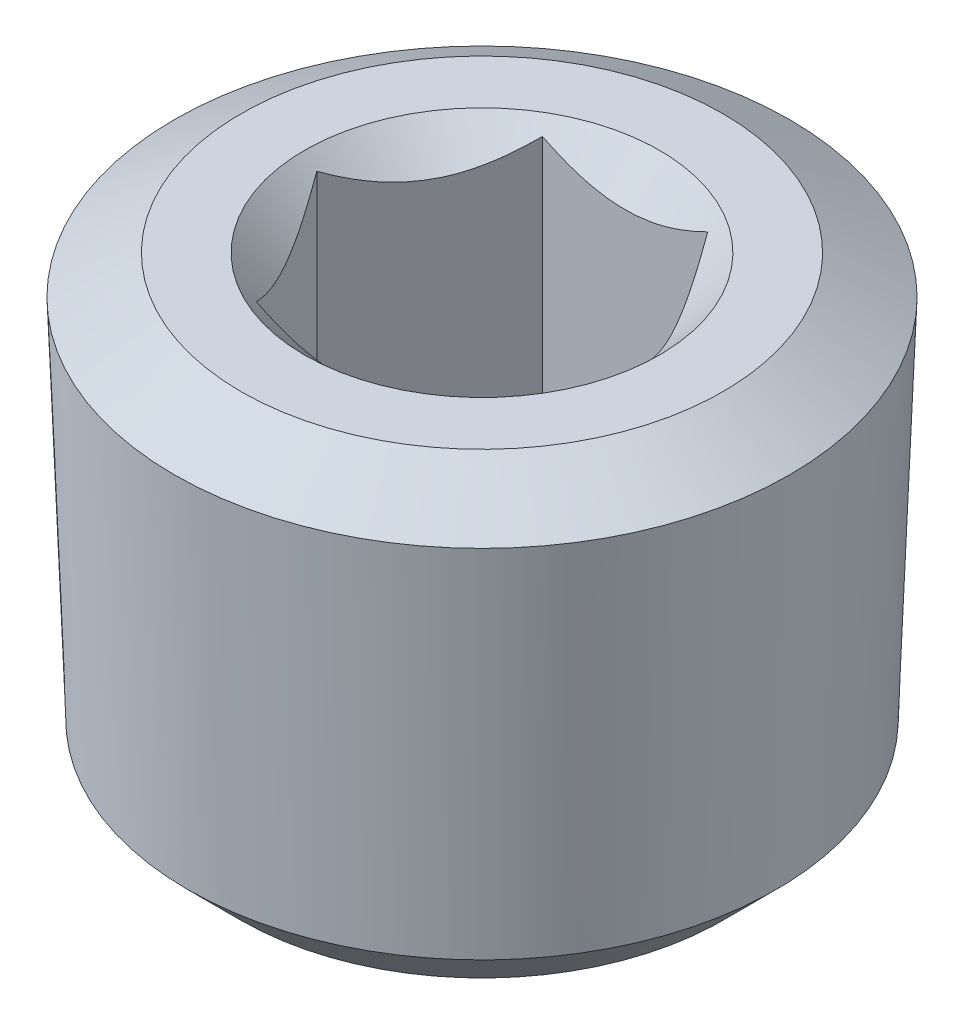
ISO-10303-21;
HEADER;
FILE_DESCRIPTION(('STEP AP214'),'2;1');
FILE_NAME('part.step','',(''),(''),'','','');
FILE_SCHEMA(('AUTOMOTIVE_DESIGN { 1 0 10303 214 1 1 1 1 }'));
ENDSEC;
DATA;
#1=APPLICATION_CONTEXT('core data for automotive mechanical design processes');
#2=APPLICATION_PROTOCOL_DEFINITION('international standard','automotive_design',2000,#1);
#3=PRODUCT_CONTEXT('',#1,'mechanical');
#4=PRODUCT('Part','Part','',(#3));
#5=PRODUCT_RELATED_PRODUCT_CATEGORY('part','',(#4));
#6=PRODUCT_DEFINITION_FORMATION('','',#4);
#7=PRODUCT_DEFINITION_CONTEXT('part definition',#1,'design');
#8=PRODUCT_DEFINITION('design','',#6,#7);
#9=PRODUCT_DEFINITION_SHAPE('','',#8);
#10=(LENGTH_UNIT() NAMED_UNIT(*) SI_UNIT(.MILLI.,.METRE.));
#11=(NAMED_UNIT(*) PLANE_ANGLE_UNIT() SI_UNIT($,.RADIAN.));
#12=(NAMED_UNIT(*) SI_UNIT($,.STERADIAN.) SOLID_ANGLE_UNIT());
#13=UNCERTAINTY_MEASURE_WITH_UNIT(LENGTH_MEASURE(1.E-05),#10,'distance_accuracy_value','');
#14=(GEOMETRIC_REPRESENTATION_CONTEXT(3) GLOBAL_UNCERTAINTY_ASSIGNED_CONTEXT((#13)) GLOBAL_UNIT_ASSIGNED_CONTEXT((#10,
#11,#12)) REPRESENTATION_CONTEXT('',''));
#15=CARTESIAN_POINT('',(0.,0.,0.));
#16=DIRECTION('',(0.,0.,1.));
#17=DIRECTION('',(1.,0.,0.));
#18=AXIS2_PLACEMENT_3D('',#15,#16,#17);
#19=CARTESIAN_POINT('',(0.,0.,0.));
#20=DIRECTION('',(0.,1.,0.));
#21=DIRECTION('',(0.,0.,1.));
#22=AXIS2_PLACEMENT_3D('',#19,#20,#21);
#23=PLANE('',#22);
#24=CARTESIAN_POINT('',(0.,0.,0.));
#25=DIRECTION('',(0.,1.,0.));
#26=DIRECTION('',(0.,0.,1.));
#27=AXIS2_PLACEMENT_3D('',#24,#25,#26);
#28=CIRCLE('',#27,3.937);
#29=CARTESIAN_POINT('',(0.,0.,3.937));
#30=VERTEX_POINT('',#29);
#31=EDGE_CURVE('E246',#30,#30,#28,.T.);
#32=ORIENTED_EDGE('',*,*,#31,.F.);
#33=EDGE_LOOP('',(#32));
#34=FACE_BOUND('',#33,.T.);
#35=CARTESIAN_POINT('',(0.,0.,0.));
#36=DIRECTION('',(0.,1.,0.));
#37=DIRECTION('',(0.,0.,1.));
#38=AXIS2_PLACEMENT_3D('',#35,#36,#37);
#39=CIRCLE('',#38,5.34458046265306);
#40=CARTESIAN_POINT('',(0.,0.,5.34458046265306));
#41=VERTEX_POINT('',#40);
#42=EDGE_CURVE('E12',#41,#41,#39,.T.);
#43=ORIENTED_EDGE('',*,*,#42,.T.);
#44=EDGE_LOOP('',(#43));
#45=FACE_BOUND('',#44,.T.);
#46=ADVANCED_FACE('F33',(#34,#45),#23,.T.);
#47=CARTESIAN_POINT('',(0.,0.,0.));
#48=DIRECTION('',(0.,-1.,0.));
#49=DIRECTION('',(0.,0.,-1.));
#50=AXIS2_PLACEMENT_3D('',#47,#48,#49);
#51=CONICAL_SURFACE('',#50,5.34458046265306,1.0471975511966);
#52=CARTESIAN_POINT('',(0.,-0.855759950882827,0.));
#53=DIRECTION('',(0.,1.,0.));
#54=DIRECTION('',(0.,0.,1.));
#55=AXIS2_PLACEMENT_3D('',#52,#53,#54);
#56=CIRCLE('',#55,6.82680017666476);
#57=CARTESIAN_POINT('',(0.,-0.855759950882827,6.82680017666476));
#58=VERTEX_POINT('',#57);
#59=EDGE_CURVE('E40',#58,#58,#56,.T.);
#60=ORIENTED_EDGE('',*,*,#59,.T.);
#61=EDGE_LOOP('',(#60));
#62=FACE_BOUND('',#61,.T.);
#63=ORIENTED_EDGE('',*,*,#42,.F.);
#64=EDGE_LOOP('',(#63));
#65=FACE_BOUND('',#64,.T.);
#66=ADVANCED_FACE('F236',(#62,#65),#51,.T.);
#67=CARTESIAN_POINT('',(0.,-0.855759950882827,0.));
#68=DIRECTION('',(0.,1.,0.));
#69=DIRECTION('',(0.,0.,1.));
#70=AXIS2_PLACEMENT_3D('',#67,#68,#69);
#71=CONICAL_SURFACE('',#70,6.82680017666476,0.0364424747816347);
#72=CARTESIAN_POINT('',(0.,-8.97375100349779,0.));
#73=DIRECTION('',(0.,1.,0.));
#74=DIRECTION('',(0.,0.,1.));
#75=AXIS2_PLACEMENT_3D('',#72,#73,#74);
#76=CIRCLE('',#75,6.53082945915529);
#77=CARTESIAN_POINT('',(0.,-8.97375100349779,6.53082945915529));
#78=VERTEX_POINT('',#77);
#79=EDGE_CURVE('E254',#78,#78,#76,.T.);
#80=ORIENTED_EDGE('',*,*,#79,.T.);
#81=EDGE_LOOP('',(#80));
#82=FACE_BOUND('',#81,.T.);
#83=ORIENTED_EDGE('',*,*,#59,.F.);
#84=EDGE_LOOP('',(#83));
#85=FACE_BOUND('',#84,.T.);
#86=ADVANCED_FACE('F241',(#82,#85),#71,.T.);
#87=CARTESIAN_POINT('',(0.,-8.97375100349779,0.));
#88=DIRECTION('',(0.,1.,0.));
#89=DIRECTION('',(0.,0.,1.));
#90=AXIS2_PLACEMENT_3D('',#87,#88,#89);
#91=CONICAL_SURFACE('',#90,6.53082945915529,0.785398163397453);
#92=CARTESIAN_POINT('',(0.,-10.16,0.));
#93=DIRECTION('',(0.,1.,0.));
#94=DIRECTION('',(0.,0.,1.));
#95=AXIS2_PLACEMENT_3D('',#92,#93,#94);
#96=CIRCLE('',#95,5.34458046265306);
#97=CARTESIAN_POINT('',(0.,-10.16,5.34458046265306));
#98=VERTEX_POINT('',#97);
#99=EDGE_CURVE('E250',#98,#98,#96,.T.);
#100=ORIENTED_EDGE('',*,*,#99,.T.);
#101=EDGE_LOOP('',(#100));
#102=FACE_BOUND('',#101,.T.);
#103=ORIENTED_EDGE('',*,*,#79,.F.);
#104=EDGE_LOOP('',(#103));
#105=FACE_BOUND('',#104,.T.);
#106=ADVANCED_FACE('F264',(#102,#105),#91,.T.);
#107=CARTESIAN_POINT('',(-5.34458046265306,-10.16,0.));
#108=DIRECTION('',(0.,-1.,0.));
#109=DIRECTION('',(0.,0.,-1.));
#110=AXIS2_PLACEMENT_3D('',#107,#108,#109);
#111=PLANE('',#110);
#112=ORIENTED_EDGE('',*,*,#99,.F.);
#113=EDGE_LOOP('',(#112));
#114=FACE_BOUND('',#113,.T.);
#115=ADVANCED_FACE('F180',(#114),#111,.T.);
#116=CARTESIAN_POINT('',(0.,0.,0.));
#117=DIRECTION('',(0.,1.,0.));
#118=DIRECTION('',(0.,0.,1.));
#119=AXIS2_PLACEMENT_3D('',#116,#117,#118);
#120=CONICAL_SURFACE('',#119,3.937,0.785398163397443);
#121=CARTESIAN_POINT('',(-3.93571910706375,1.11972916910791,3.175));
#122=CARTESIAN_POINT('',(-3.84104338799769,1.04605819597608,3.175));
#123=CARTESIAN_POINT('',(-3.7458702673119,0.973016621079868,3.175));
#124=CARTESIAN_POINT('',(-3.55432152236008,0.828483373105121,3.175));
#125=CARTESIAN_POINT('',(-3.45794562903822,0.756992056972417,3.175));
#126=CARTESIAN_POINT('',(-3.26308115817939,0.615342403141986,3.175));
#127=CARTESIAN_POINT('',(-3.1645820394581,0.545198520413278,3.175));
#128=CARTESIAN_POINT('',(-2.96596703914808,0.407246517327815,3.175));
#129=CARTESIAN_POINT('',(-2.86585126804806,0.339438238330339,3.175));
#130=CARTESIAN_POINT('',(-2.65689636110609,0.202214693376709,3.175));
#131=CARTESIAN_POINT('',(-2.5479247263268,0.133000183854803,3.175));
#132=CARTESIAN_POINT('',(-2.32741654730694,-0.0012864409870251,3.175));
#133=CARTESIAN_POINT('',(-2.21587956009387,-0.0663578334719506,3.175));
#134=CARTESIAN_POINT('',(-1.99018437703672,-0.190984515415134,3.175));
#135=CARTESIAN_POINT('',(-1.87603517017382,-0.250555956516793,3.175));
#136=CARTESIAN_POINT('',(-1.64444175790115,-0.362847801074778,3.175));
#137=CARTESIAN_POINT('',(-1.52699917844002,-0.415571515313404,3.175));
#138=CARTESIAN_POINT('',(-1.30155237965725,-0.506949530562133,3.175));
#139=CARTESIAN_POINT('',(-1.1939199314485,-0.546511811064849,3.175));
#140=CARTESIAN_POINT('',(-0.975818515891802,-0.61702882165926,3.175));
#141=CARTESIAN_POINT('',(-0.865349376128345,-0.647983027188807,3.175));
#142=CARTESIAN_POINT('',(-0.644216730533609,-0.699051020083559,3.175));
#143=CARTESIAN_POINT('',(-0.53360121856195,-0.719369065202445,3.175));
#144=CARTESIAN_POINT('',(-0.310874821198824,-0.748724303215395,3.175));
#145=CARTESIAN_POINT('',(-0.198764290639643,-0.757764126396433,3.175));
#146=CARTESIAN_POINT('',(0.0202799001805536,-0.763730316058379,3.175));
#147=CARTESIAN_POINT('',(0.127198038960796,-0.761228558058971,3.175));
#148=CARTESIAN_POINT('',(0.340248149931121,-0.745589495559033,3.175));
#149=CARTESIAN_POINT('',(0.446380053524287,-0.732451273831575,3.175));
#150=CARTESIAN_POINT('',(0.658892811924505,-0.696075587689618,3.175));
#151=CARTESIAN_POINT('',(0.765241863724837,-0.672655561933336,3.175));
#152=CARTESIAN_POINT('',(0.975578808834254,-0.617048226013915,3.175));
#153=CARTESIAN_POINT('',(1.07956679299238,-0.584861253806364,3.175));
#154=CARTESIAN_POINT('',(1.28885040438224,-0.511832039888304,3.175));
#155=CARTESIAN_POINT('',(1.39404662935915,-0.470708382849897,3.175));
#156=CARTESIAN_POINT('',(1.60173093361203,-0.382096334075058,3.175));
#157=CARTESIAN_POINT('',(1.70421815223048,-0.334605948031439,3.175));
#158=CARTESIAN_POINT('',(1.90698237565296,-0.234377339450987,3.175));
#159=CARTESIAN_POINT('',(2.0072512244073,-0.18162275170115,3.175));
#160=CARTESIAN_POINT('',(2.20549346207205,-0.0720283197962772,3.175));
#161=CARTESIAN_POINT('',(2.30346724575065,-0.0151891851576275,3.175));
#162=CARTESIAN_POINT('',(2.49264239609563,0.0988994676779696,3.175));
#163=CARTESIAN_POINT('',(2.58393963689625,0.155990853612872,3.175));
#164=CARTESIAN_POINT('',(2.76496520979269,0.272616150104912,3.175));
#165=CARTESIAN_POINT('',(2.85469342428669,0.3321502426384,3.175));
#166=CARTESIAN_POINT('',(3.03206818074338,0.45274472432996,3.175));
#167=CARTESIAN_POINT('',(3.11972562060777,0.513789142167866,3.175));
#168=CARTESIAN_POINT('',(3.29383610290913,0.637523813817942,3.175));
#169=CARTESIAN_POINT('',(3.38028947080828,0.700213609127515,3.175));
#170=CARTESIAN_POINT('',(3.46623735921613,0.763577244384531,3.175));
#171=B_SPLINE_CURVE_WITH_KNOTS('',3,(#121,#122,#123,#124,#125,#126,#127,#128,#129,#130,#131,
#132,#133,#134,#135,#136,#137,#138,#139,#140,#141,#142,#143,#144,#145,#146,#147,#148,#149,#150,
#151,#152,#153,#154,#155,#156,#157,#158,#159,#160,#161,#162,#163,#164,#165,#166,#167,#168,#169,
#170),.UNSPECIFIED.,.F.,.F.,(4,2,2,2,2,2,2,2,2,2,2,2,2,2,2,2,2,2,2,2,2,2,2,2,4),(0.,
0.359892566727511,0.719867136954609,1.08260645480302,1.44532108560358,1.83253224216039,
2.21981077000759,2.60591317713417,2.99182820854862,3.33555423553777,3.67930120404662,
4.01617928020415,4.35297877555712,4.67327447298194,4.99359779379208,5.31985449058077,
5.64609861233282,5.98468714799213,6.32338199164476,6.66316466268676,7.00288845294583,
7.3258777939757,7.64889124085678,7.96932699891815,8.28967439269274),.UNSPECIFIED.);
#172=CARTESIAN_POINT('',(1.83308710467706,-0.27082579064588,3.175));
#173=VERTEX_POINT('',#172);
#174=CARTESIAN_POINT('',(-1.83308710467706,-0.27082579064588,3.175));
#175=VERTEX_POINT('',#174);
#176=EDGE_CURVE('E47',#173,#175,#171,.F.);
#177=ORIENTED_EDGE('',*,*,#176,.T.);
#178=CARTESIAN_POINT('',(-1.83297163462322,-0.270710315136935,3.1752));
#179=CARTESIAN_POINT('',(-1.89598269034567,-0.333666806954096,3.06606165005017));
#180=CARTESIAN_POINT('',(-1.9600473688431,-0.392925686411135,2.95509837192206));
#181=CARTESIAN_POINT('',(-2.09068223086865,-0.501427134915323,2.72883215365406));
#182=CARTESIAN_POINT('',(-2.15726483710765,-0.550609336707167,2.61350769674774));
#183=CARTESIAN_POINT('',(-2.29152545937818,-0.634859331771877,2.38096147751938));
#184=CARTESIAN_POINT('',(-2.35916928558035,-0.670138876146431,2.26379893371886));
#185=CARTESIAN_POINT('',(-2.49594609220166,-0.724494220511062,2.02689455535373));
#186=CARTESIAN_POINT('',(-2.56507489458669,-0.743610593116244,1.90715995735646));
#187=CARTESIAN_POINT('',(-2.68421566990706,-0.760858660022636,1.70080208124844));
#188=CARTESIAN_POINT('',(-2.73407378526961,-0.763411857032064,1.61444529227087));
#189=CARTESIAN_POINT('',(-2.83370891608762,-0.759109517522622,1.44187218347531));
#190=CARTESIAN_POINT('',(-2.88348589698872,-0.752250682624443,1.35565592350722));
#191=CARTESIAN_POINT('',(-2.98256827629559,-0.729515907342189,1.1840402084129));
#192=CARTESIAN_POINT('',(-3.03187308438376,-0.713629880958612,1.09864177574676));
#193=CARTESIAN_POINT('',(-3.12963590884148,-0.673707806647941,0.929311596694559));
#194=CARTESIAN_POINT('',(-3.17809398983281,-0.649672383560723,0.845379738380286));
#195=CARTESIAN_POINT('',(-3.26412109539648,-0.600220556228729,0.696376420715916));
#196=CARTESIAN_POINT('',(-3.30188053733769,-0.576104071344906,0.630975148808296));
#197=CARTESIAN_POINT('',(-3.37672152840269,-0.523984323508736,0.501346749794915));
#198=CARTESIAN_POINT('',(-3.41380305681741,-0.495980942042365,0.437119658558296));
#199=CARTESIAN_POINT('',(-3.48717139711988,-0.436715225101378,0.310041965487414));
#200=CARTESIAN_POINT('',(-3.52346029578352,-0.405463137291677,0.247187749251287));
#201=CARTESIAN_POINT('',(-3.59536602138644,-0.340110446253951,0.122643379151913));
#202=CARTESIAN_POINT('',(-3.63098324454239,-0.306011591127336,0.0609525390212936));
#203=CARTESIAN_POINT('',(-3.66628967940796,-0.270710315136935,-0.000199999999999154));
#204=B_SPLINE_CURVE_WITH_KNOTS('',3,(#178,#179,#180,#181,#182,#183,#184,#185,#186,#187,#188,
#189,#190,#191,#192,#193,#194,#195,#196,#197,#198,#199,#200,#201,#202,#203),.UNSPECIFIED.,.F.,
.F.,(4,2,2,2,2,2,2,2,2,2,2,2,4),(0.,0.422910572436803,0.848285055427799,1.26690402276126,
1.68446903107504,1.98329272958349,2.28222117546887,2.58148426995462,2.88072442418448,
3.11844134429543,3.35616551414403,3.59316134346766,3.8300126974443),.UNSPECIFIED.);
#205=CARTESIAN_POINT('',(-3.66617420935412,-0.270825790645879,0.));
#206=VERTEX_POINT('',#205);
#207=EDGE_CURVE('E122',#175,#206,#204,.T.);
#208=ORIENTED_EDGE('',*,*,#207,.T.);
#209=CARTESIAN_POINT('',(-3.66628967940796,-0.270710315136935,0.000200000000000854));
#210=CARTESIAN_POINT('',(-3.60327862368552,-0.333666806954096,-0.108938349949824));
#211=CARTESIAN_POINT('',(-3.53921394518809,-0.392925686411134,-0.219901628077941));
#212=CARTESIAN_POINT('',(-3.40857908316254,-0.501427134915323,-0.44616784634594));
#213=CARTESIAN_POINT('',(-3.34199647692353,-0.550609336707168,-0.561492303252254));
#214=CARTESIAN_POINT('',(-3.20773585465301,-0.634859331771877,-0.794038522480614));
#215=CARTESIAN_POINT('',(-3.14009202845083,-0.670138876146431,-0.911201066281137));
#216=CARTESIAN_POINT('',(-3.00331522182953,-0.724494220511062,-1.14810544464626));
#217=CARTESIAN_POINT('',(-2.93418641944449,-0.743610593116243,-1.26784004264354));
#218=CARTESIAN_POINT('',(-2.81504564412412,-0.760858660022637,-1.47419791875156));
#219=CARTESIAN_POINT('',(-2.76518752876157,-0.763411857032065,-1.56055470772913));
#220=CARTESIAN_POINT('',(-2.66555239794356,-0.759109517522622,-1.73312781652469));
#221=CARTESIAN_POINT('',(-2.61577541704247,-0.752250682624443,-1.81934407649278));
#222=CARTESIAN_POINT('',(-2.51669303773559,-0.729515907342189,-1.9909597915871));
#223=CARTESIAN_POINT('',(-2.46738822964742,-0.713629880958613,-2.07635822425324));
#224=CARTESIAN_POINT('',(-2.36962540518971,-0.673707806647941,-2.24568840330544));
#225=CARTESIAN_POINT('',(-2.32116732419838,-0.649672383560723,-2.32962026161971));
#226=CARTESIAN_POINT('',(-2.2351402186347,-0.600220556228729,-2.47862357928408));
#227=CARTESIAN_POINT('',(-2.1973807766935,-0.576104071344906,-2.5440248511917));
#228=CARTESIAN_POINT('',(-2.1225397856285,-0.523984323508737,-2.67365325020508));
#229=CARTESIAN_POINT('',(-2.08545825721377,-0.495980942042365,-2.7378803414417));
#230=CARTESIAN_POINT('',(-2.0120899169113,-0.436715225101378,-2.86495803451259));
#231=CARTESIAN_POINT('',(-1.97580101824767,-0.405463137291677,-2.92781225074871));
#232=CARTESIAN_POINT('',(-1.90389529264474,-0.340110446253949,-3.05235662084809));
#233=CARTESIAN_POINT('',(-1.8682780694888,-0.306011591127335,-3.11404746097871));
#234=CARTESIAN_POINT('',(-1.83297163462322,-0.270710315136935,-3.1752));
#235=B_SPLINE_CURVE_WITH_KNOTS('',3,(#209,#210,#211,#212,#213,#214,#215,#216,#217,#218,#219,
#220,#221,#222,#223,#224,#225,#226,#227,#228,#229,#230,#231,#232,#233,#234),.UNSPECIFIED.,.F.,
.F.,(4,2,2,2,2,2,2,2,2,2,2,2,4),(0.,0.422910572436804,0.848285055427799,1.26690402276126,
1.68446903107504,1.98329272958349,2.28222117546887,2.58148426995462,2.88072442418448,
3.11844134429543,3.35616551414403,3.59316134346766,3.8300126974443),.UNSPECIFIED.);
#236=CARTESIAN_POINT('',(-1.83308710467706,-0.270825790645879,-3.175));
#237=VERTEX_POINT('',#236);
#238=EDGE_CURVE('E203',#206,#237,#235,.T.);
#239=ORIENTED_EDGE('',*,*,#238,.T.);
#240=CARTESIAN_POINT('',(-3.93571910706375,1.11972916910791,-3.175));
#241=CARTESIAN_POINT('',(-3.84104338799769,1.04605819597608,-3.175));
#242=CARTESIAN_POINT('',(-3.7458702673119,0.97301662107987,-3.175));
#243=CARTESIAN_POINT('',(-3.55432152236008,0.828483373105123,-3.175));
#244=CARTESIAN_POINT('',(-3.45794562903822,0.756992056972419,-3.175));
#245=CARTESIAN_POINT('',(-3.26308115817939,0.615342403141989,-3.175));
#246=CARTESIAN_POINT('',(-3.1645820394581,0.545198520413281,-3.175));
#247=CARTESIAN_POINT('',(-2.96596703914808,0.407246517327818,-3.175));
#248=CARTESIAN_POINT('',(-2.86585126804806,0.339438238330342,-3.175));
#249=CARTESIAN_POINT('',(-2.6568963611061,0.20221469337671,-3.175));
#250=CARTESIAN_POINT('',(-2.54792472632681,0.133000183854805,-3.175));
#251=CARTESIAN_POINT('',(-2.32741654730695,-0.00128644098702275,-3.175));
#252=CARTESIAN_POINT('',(-2.21587956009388,-0.0663578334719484,-3.175));
#253=CARTESIAN_POINT('',(-1.99018437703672,-0.190984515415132,-3.175));
#254=CARTESIAN_POINT('',(-1.87603517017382,-0.250555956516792,-3.175));
#255=CARTESIAN_POINT('',(-1.64444175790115,-0.362847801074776,-3.175));
#256=CARTESIAN_POINT('',(-1.52699917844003,-0.415571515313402,-3.175));
#257=CARTESIAN_POINT('',(-1.30155237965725,-0.506949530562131,-3.175));
#258=CARTESIAN_POINT('',(-1.1939199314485,-0.546511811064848,-3.175));
#259=CARTESIAN_POINT('',(-0.975818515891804,-0.617028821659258,-3.175));
#260=CARTESIAN_POINT('',(-0.865349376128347,-0.647983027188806,-3.175));
#261=CARTESIAN_POINT('',(-0.64421673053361,-0.699051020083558,-3.175));
#262=CARTESIAN_POINT('',(-0.533601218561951,-0.719369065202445,-3.175));
#263=CARTESIAN_POINT('',(-0.310874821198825,-0.748724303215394,-3.175));
#264=CARTESIAN_POINT('',(-0.198764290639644,-0.757764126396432,-3.175));
#265=CARTESIAN_POINT('',(0.0202799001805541,-0.763730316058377,-3.175));
#266=CARTESIAN_POINT('',(0.127198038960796,-0.761228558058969,-3.175));
#267=CARTESIAN_POINT('',(0.340248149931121,-0.745589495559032,-3.175));
#268=CARTESIAN_POINT('',(0.446380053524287,-0.732451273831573,-3.175));
#269=CARTESIAN_POINT('',(0.658892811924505,-0.696075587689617,-3.175));
#270=CARTESIAN_POINT('',(0.765241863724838,-0.672655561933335,-3.175));
#271=CARTESIAN_POINT('',(0.975578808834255,-0.617048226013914,-3.175));
#272=CARTESIAN_POINT('',(1.07956679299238,-0.584861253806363,-3.175));
#273=CARTESIAN_POINT('',(1.28885040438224,-0.511832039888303,-3.175));
#274=CARTESIAN_POINT('',(1.39404662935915,-0.470708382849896,-3.175));
#275=CARTESIAN_POINT('',(1.60173093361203,-0.382096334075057,-3.175));
#276=CARTESIAN_POINT('',(1.70421815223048,-0.334605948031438,-3.175));
#277=CARTESIAN_POINT('',(1.90698237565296,-0.234377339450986,-3.175));
#278=CARTESIAN_POINT('',(2.0072512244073,-0.181622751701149,-3.175));
#279=CARTESIAN_POINT('',(2.20549346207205,-0.0720283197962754,-3.175));
#280=CARTESIAN_POINT('',(2.30346724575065,-0.0151891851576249,-3.175));
#281=CARTESIAN_POINT('',(2.49264239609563,0.0988994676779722,-3.175));
#282=CARTESIAN_POINT('',(2.58393963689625,0.155990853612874,-3.175));
#283=CARTESIAN_POINT('',(2.76496520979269,0.272616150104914,-3.175));
#284=CARTESIAN_POINT('',(2.85469342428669,0.332150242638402,-3.175));
#285=CARTESIAN_POINT('',(3.03206818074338,0.452744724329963,-3.175));
#286=CARTESIAN_POINT('',(3.11972562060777,0.513789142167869,-3.175));
#287=CARTESIAN_POINT('',(3.29383610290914,0.637523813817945,-3.175));
#288=CARTESIAN_POINT('',(3.38028947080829,0.700213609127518,-3.175));
#289=CARTESIAN_POINT('',(3.46623735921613,0.763577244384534,-3.175));
#290=B_SPLINE_CURVE_WITH_KNOTS('',3,(#240,#241,#242,#243,#244,#245,#246,#247,#248,#249,#250,
#251,#252,#253,#254,#255,#256,#257,#258,#259,#260,#261,#262,#263,#264,#265,#266,#267,#268,#269,
#270,#271,#272,#273,#274,#275,#276,#277,#278,#279,#280,#281,#282,#283,#284,#285,#286,#287,#288,
#289),.UNSPECIFIED.,.F.,.F.,(4,2,2,2,2,2,2,2,2,2,2,2,2,2,2,2,2,2,2,2,2,2,2,2,4),(0.,
0.35989256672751,0.719867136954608,1.08260645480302,1.44532108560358,1.83253224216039,
2.21981077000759,2.60591317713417,2.99182820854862,3.33555423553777,3.67930120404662,
4.01617928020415,4.35297877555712,4.67327447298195,4.99359779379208,5.31985449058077,
5.64609861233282,5.98468714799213,6.32338199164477,6.66316466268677,7.00288845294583,
7.3258777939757,7.64889124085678,7.96932699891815,8.28967439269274),.UNSPECIFIED.);
#291=CARTESIAN_POINT('',(1.83308710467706,-0.27082579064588,-3.175));
#292=VERTEX_POINT('',#291);
#293=EDGE_CURVE('E196',#237,#292,#290,.T.);
#294=ORIENTED_EDGE('',*,*,#293,.T.);
#295=CARTESIAN_POINT('',(1.83297163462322,-0.270710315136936,-3.1752));
#296=CARTESIAN_POINT('',(1.89598269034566,-0.333666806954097,-3.06606165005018));
#297=CARTESIAN_POINT('',(1.9600473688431,-0.392925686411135,-2.95509837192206));
#298=CARTESIAN_POINT('',(2.09068223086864,-0.501427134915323,-2.72883215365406));
#299=CARTESIAN_POINT('',(2.15726483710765,-0.550609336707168,-2.61350769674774));
#300=CARTESIAN_POINT('',(2.29152545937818,-0.634859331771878,-2.38096147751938));
#301=CARTESIAN_POINT('',(2.35916928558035,-0.670138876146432,-2.26379893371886));
#302=CARTESIAN_POINT('',(2.49594609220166,-0.724494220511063,-2.02689455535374));
#303=CARTESIAN_POINT('',(2.56507489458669,-0.743610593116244,-1.90715995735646));
#304=CARTESIAN_POINT('',(2.68421566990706,-0.760858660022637,-1.70080208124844));
#305=CARTESIAN_POINT('',(2.73407378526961,-0.763411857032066,-1.61444529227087));
#306=CARTESIAN_POINT('',(2.83370891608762,-0.759109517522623,-1.44187218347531));
#307=CARTESIAN_POINT('',(2.88348589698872,-0.752250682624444,-1.35565592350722));
#308=CARTESIAN_POINT('',(2.98256827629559,-0.72951590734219,-1.1840402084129));
#309=CARTESIAN_POINT('',(3.03187308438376,-0.713629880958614,-1.09864177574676));
#310=CARTESIAN_POINT('',(3.12963590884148,-0.673707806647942,-0.92931159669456));
#311=CARTESIAN_POINT('',(3.17809398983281,-0.649672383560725,-0.845379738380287));
#312=CARTESIAN_POINT('',(3.26412109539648,-0.60022055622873,-0.696376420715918));
#313=CARTESIAN_POINT('',(3.30188053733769,-0.576104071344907,-0.630975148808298));
#314=CARTESIAN_POINT('',(3.37672152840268,-0.523984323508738,-0.501346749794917));
#315=CARTESIAN_POINT('',(3.41380305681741,-0.495980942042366,-0.437119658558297));
#316=CARTESIAN_POINT('',(3.48717139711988,-0.436715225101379,-0.310041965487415));
#317=CARTESIAN_POINT('',(3.52346029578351,-0.405463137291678,-0.247187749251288));
#318=CARTESIAN_POINT('',(3.59536602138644,-0.340110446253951,-0.122643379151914));
#319=CARTESIAN_POINT('',(3.63098324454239,-0.306011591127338,-0.0609525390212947));
#320=CARTESIAN_POINT('',(3.66628967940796,-0.270710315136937,0.000199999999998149));
#321=B_SPLINE_CURVE_WITH_KNOTS('',3,(#295,#296,#297,#298,#299,#300,#301,#302,#303,#304,#305,
#306,#307,#308,#309,#310,#311,#312,#313,#314,#315,#316,#317,#318,#319,#320),.UNSPECIFIED.,.F.,
.F.,(4,2,2,2,2,2,2,2,2,2,2,2,4),(0.,0.422910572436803,0.848285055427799,1.26690402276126,
1.68446903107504,1.98329272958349,2.28222117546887,2.58148426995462,2.88072442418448,
3.11844134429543,3.35616551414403,3.59316134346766,3.8300126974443),.UNSPECIFIED.);
#322=CARTESIAN_POINT('',(3.66617420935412,-0.270825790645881,0.));
#323=VERTEX_POINT('',#322);
#324=EDGE_CURVE('E189',#292,#323,#321,.T.);
#325=ORIENTED_EDGE('',*,*,#324,.T.);
#326=CARTESIAN_POINT('',(3.66628967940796,-0.270710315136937,-0.000200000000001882));
#327=CARTESIAN_POINT('',(3.60327862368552,-0.333666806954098,0.108938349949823));
#328=CARTESIAN_POINT('',(3.53921394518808,-0.392925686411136,0.219901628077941));
#329=CARTESIAN_POINT('',(3.40857908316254,-0.501427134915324,0.44616784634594));
#330=CARTESIAN_POINT('',(3.34199647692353,-0.550609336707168,0.561492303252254));
#331=CARTESIAN_POINT('',(3.20773585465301,-0.634859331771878,0.794038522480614));
#332=CARTESIAN_POINT('',(3.14009202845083,-0.670138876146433,0.911201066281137));
#333=CARTESIAN_POINT('',(3.00331522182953,-0.724494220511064,1.14810544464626));
#334=CARTESIAN_POINT('',(2.93418641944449,-0.743610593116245,1.26784004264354));
#335=CARTESIAN_POINT('',(2.81504564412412,-0.760858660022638,1.47419791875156));
#336=CARTESIAN_POINT('',(2.76518752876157,-0.763411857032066,1.56055470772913));
#337=CARTESIAN_POINT('',(2.66555239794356,-0.759109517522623,1.73312781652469));
#338=CARTESIAN_POINT('',(2.61577541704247,-0.752250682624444,1.81934407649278));
#339=CARTESIAN_POINT('',(2.51669303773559,-0.72951590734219,1.9909597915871));
#340=CARTESIAN_POINT('',(2.46738822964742,-0.713629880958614,2.07635822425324));
#341=CARTESIAN_POINT('',(2.36962540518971,-0.673707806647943,2.24568840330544));
#342=CARTESIAN_POINT('',(2.32116732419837,-0.649672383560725,2.32962026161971));
#343=CARTESIAN_POINT('',(2.2351402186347,-0.60022055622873,2.47862357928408));
#344=CARTESIAN_POINT('',(2.1973807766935,-0.576104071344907,2.5440248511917));
#345=CARTESIAN_POINT('',(2.1225397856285,-0.523984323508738,2.67365325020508));
#346=CARTESIAN_POINT('',(2.08545825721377,-0.495980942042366,2.7378803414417));
#347=CARTESIAN_POINT('',(2.0120899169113,-0.436715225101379,2.86495803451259));
#348=CARTESIAN_POINT('',(1.97580101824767,-0.405463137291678,2.92781225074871));
#349=CARTESIAN_POINT('',(1.90389529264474,-0.340110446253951,3.05235662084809));
#350=CARTESIAN_POINT('',(1.8682780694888,-0.306011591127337,3.11404746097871));
#351=CARTESIAN_POINT('',(1.83297163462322,-0.270710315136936,3.1752));
#352=B_SPLINE_CURVE_WITH_KNOTS('',3,(#326,#327,#328,#329,#330,#331,#332,#333,#334,#335,#336,
#337,#338,#339,#340,#341,#342,#343,#344,#345,#346,#347,#348,#349,#350,#351),.UNSPECIFIED.,.F.,
.F.,(4,2,2,2,2,2,2,2,2,2,2,2,4),(0.,0.422910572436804,0.8482850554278,1.26690402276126,
1.68446903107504,1.98329272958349,2.28222117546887,2.58148426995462,2.88072442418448,
3.11844134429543,3.35616551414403,3.59316134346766,3.8300126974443),.UNSPECIFIED.);
#353=EDGE_CURVE('E166',#323,#173,#352,.T.);
#354=ORIENTED_EDGE('',*,*,#353,.T.);
#355=EDGE_LOOP('',(#177,#208,#239,#294,#325,#354));
#356=FACE_BOUND('',#355,.T.);
#357=ORIENTED_EDGE('',*,*,#31,.T.);
#358=EDGE_LOOP('',(#357));
#359=FACE_BOUND('',#358,.T.);
#360=ADVANCED_FACE('F175',(#356,#359),#120,.F.);
#361=CARTESIAN_POINT('',(-3.66617420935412,-5.588,0.));
#362=DIRECTION('',(-0.866025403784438,0.,0.5));
#363=DIRECTION('',(0.5,0.,0.866025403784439));
#364=AXIS2_PLACEMENT_3D('',#361,#362,#363);
#365=PLANE('',#364);
#366=DIRECTION('',(0.,1.,0.));
#367=VECTOR('',#366,1.);
#368=CARTESIAN_POINT('',(-1.83308710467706,-5.588,3.175));
#369=LINE('',#368,#367);
#370=CARTESIAN_POINT('',(-1.83308710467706,-5.588,3.175));
#371=VERTEX_POINT('',#370);
#372=EDGE_CURVE('E119',#371,#175,#369,.T.);
#373=ORIENTED_EDGE('',*,*,#372,.F.);
#374=DIRECTION('',(0.5,0.,0.866025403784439));
#375=VECTOR('',#374,1.);
#376=CARTESIAN_POINT('',(-3.66617420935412,-5.588,0.));
#377=LINE('',#376,#375);
#378=CARTESIAN_POINT('',(-2.74963065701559,-5.588,1.5875));
#379=VERTEX_POINT('',#378);
#380=EDGE_CURVE('E106',#379,#371,#377,.T.);
#381=ORIENTED_EDGE('',*,*,#380,.F.);
#382=CARTESIAN_POINT('',(-3.66617420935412,-5.588,0.));
#383=VERTEX_POINT('',#382);
#384=EDGE_CURVE('E116',#383,#379,#377,.T.);
#385=ORIENTED_EDGE('',*,*,#384,.F.);
#386=DIRECTION('',(0.,1.,0.));
#387=VECTOR('',#386,1.);
#388=CARTESIAN_POINT('',(-3.66617420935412,-5.588,0.));
#389=LINE('',#388,#387);
#390=EDGE_CURVE('E146',#383,#206,#389,.T.);
#391=ORIENTED_EDGE('',*,*,#390,.T.);
#392=ORIENTED_EDGE('',*,*,#207,.F.);
#393=EDGE_LOOP('',(#373,#381,#385,#391,#392));
#394=FACE_BOUND('',#393,.T.);
#395=ADVANCED_FACE('F120',(#394),#365,.F.);
#396=CARTESIAN_POINT('',(-1.83308710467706,-5.588,-3.175));
#397=DIRECTION('',(-0.866025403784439,0.,-0.5));
#398=DIRECTION('',(-0.5,0.,0.866025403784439));
#399=AXIS2_PLACEMENT_3D('',#396,#397,#398);
#400=PLANE('',#399);
#401=ORIENTED_EDGE('',*,*,#390,.F.);
#402=DIRECTION('',(-0.5,0.,0.866025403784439));
#403=VECTOR('',#402,1.);
#404=CARTESIAN_POINT('',(-1.83308710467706,-5.588,-3.175));
#405=LINE('',#404,#403);
#406=CARTESIAN_POINT('',(-2.74963065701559,-5.588,-1.5875));
#407=VERTEX_POINT('',#406);
#408=EDGE_CURVE('E143',#407,#383,#405,.T.);
#409=ORIENTED_EDGE('',*,*,#408,.F.);
#410=CARTESIAN_POINT('',(-1.83308710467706,-5.588,-3.175));
#411=VERTEX_POINT('',#410);
#412=EDGE_CURVE('E125',#411,#407,#405,.T.);
#413=ORIENTED_EDGE('',*,*,#412,.F.);
#414=DIRECTION('',(0.,1.,0.));
#415=VECTOR('',#414,1.);
#416=CARTESIAN_POINT('',(-1.83308710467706,-5.588,-3.175));
#417=LINE('',#416,#415);
#418=EDGE_CURVE('E148',#411,#237,#417,.T.);
#419=ORIENTED_EDGE('',*,*,#418,.T.);
#420=ORIENTED_EDGE('',*,*,#238,.F.);
#421=EDGE_LOOP('',(#401,#409,#413,#419,#420));
#422=FACE_BOUND('',#421,.T.);
#423=ADVANCED_FACE('F214',(#422),#400,.F.);
#424=CARTESIAN_POINT('',(1.83308710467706,-5.588,-3.175));
#425=DIRECTION('',(0.,0.,-1.));
#426=DIRECTION('',(-1.,0.,0.));
#427=AXIS2_PLACEMENT_3D('',#424,#425,#426);
#428=PLANE('',#427);
#429=ORIENTED_EDGE('',*,*,#418,.F.);
#430=DIRECTION('',(-1.,0.,0.));
#431=VECTOR('',#430,1.);
#432=CARTESIAN_POINT('',(1.83308710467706,-5.588,-3.175));
#433=LINE('',#432,#431);
#434=CARTESIAN_POINT('',(0.,-5.588,-3.175));
#435=VERTEX_POINT('',#434);
#436=EDGE_CURVE('E139',#435,#411,#433,.T.);
#437=ORIENTED_EDGE('',*,*,#436,.F.);
#438=CARTESIAN_POINT('',(1.83308710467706,-5.588,-3.175));
#439=VERTEX_POINT('',#438);
#440=EDGE_CURVE('E140',#439,#435,#433,.T.);
#441=ORIENTED_EDGE('',*,*,#440,.F.);
#442=DIRECTION('',(0.,1.,0.));
#443=VECTOR('',#442,1.);
#444=CARTESIAN_POINT('',(1.83308710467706,-5.588,-3.175));
#445=LINE('',#444,#443);
#446=EDGE_CURVE('E151',#439,#292,#445,.T.);
#447=ORIENTED_EDGE('',*,*,#446,.T.);
#448=ORIENTED_EDGE('',*,*,#293,.F.);
#449=EDGE_LOOP('',(#429,#437,#441,#447,#448));
#450=FACE_BOUND('',#449,.T.);
#451=ADVANCED_FACE('F218',(#450),#428,.F.);
#452=CARTESIAN_POINT('',(3.66617420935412,-5.588,0.));
#453=DIRECTION('',(0.866025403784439,0.,-0.5));
#454=DIRECTION('',(-0.5,0.,-0.866025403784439));
#455=AXIS2_PLACEMENT_3D('',#452,#453,#454);
#456=PLANE('',#455);
#457=ORIENTED_EDGE('',*,*,#446,.F.);
#458=DIRECTION('',(-0.5,0.,-0.866025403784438));
#459=VECTOR('',#458,1.);
#460=CARTESIAN_POINT('',(3.66617420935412,-5.588,0.));
#461=LINE('',#460,#459);
#462=CARTESIAN_POINT('',(2.74963065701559,-5.588,-1.5875));
#463=VERTEX_POINT('',#462);
#464=EDGE_CURVE('E135',#463,#439,#461,.T.);
#465=ORIENTED_EDGE('',*,*,#464,.F.);
#466=CARTESIAN_POINT('',(3.66617420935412,-5.588,0.));
#467=VERTEX_POINT('',#466);
#468=EDGE_CURVE('E136',#467,#463,#461,.T.);
#469=ORIENTED_EDGE('',*,*,#468,.F.);
#470=DIRECTION('',(0.,1.,0.));
#471=VECTOR('',#470,1.);
#472=CARTESIAN_POINT('',(3.66617420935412,-5.588,0.));
#473=LINE('',#472,#471);
#474=EDGE_CURVE('E154',#467,#323,#473,.T.);
#475=ORIENTED_EDGE('',*,*,#474,.T.);
#476=ORIENTED_EDGE('',*,*,#324,.F.);
#477=EDGE_LOOP('',(#457,#465,#469,#475,#476));
#478=FACE_BOUND('',#477,.T.);
#479=ADVANCED_FACE('F222',(#478),#456,.F.);
#480=CARTESIAN_POINT('',(1.83308710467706,-5.588,3.175));
#481=DIRECTION('',(0.866025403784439,0.,0.5));
#482=DIRECTION('',(0.5,0.,-0.866025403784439));
#483=AXIS2_PLACEMENT_3D('',#480,#481,#482);
#484=PLANE('',#483);
#485=ORIENTED_EDGE('',*,*,#474,.F.);
#486=DIRECTION('',(0.5,0.,-0.866025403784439));
#487=VECTOR('',#486,1.);
#488=CARTESIAN_POINT('',(1.83308710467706,-5.588,3.175));
#489=LINE('',#488,#487);
#490=CARTESIAN_POINT('',(2.74963065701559,-5.588,1.5875));
#491=VERTEX_POINT('',#490);
#492=EDGE_CURVE('E131',#491,#467,#489,.T.);
#493=ORIENTED_EDGE('',*,*,#492,.F.);
#494=CARTESIAN_POINT('',(1.83308710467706,-5.588,3.175));
#495=VERTEX_POINT('',#494);
#496=EDGE_CURVE('E55',#495,#491,#489,.T.);
#497=ORIENTED_EDGE('',*,*,#496,.F.);
#498=DIRECTION('',(0.,1.,0.));
#499=VECTOR('',#498,1.);
#500=CARTESIAN_POINT('',(1.83308710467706,-5.588,3.175));
#501=LINE('',#500,#499);
#502=EDGE_CURVE('E124',#495,#173,#501,.T.);
#503=ORIENTED_EDGE('',*,*,#502,.T.);
#504=ORIENTED_EDGE('',*,*,#353,.F.);
#505=EDGE_LOOP('',(#485,#493,#497,#503,#504));
#506=FACE_BOUND('',#505,.T.);
#507=ADVANCED_FACE('F226',(#506),#484,.F.);
#508=CARTESIAN_POINT('',(-1.83308710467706,-5.588,3.175));
#509=DIRECTION('',(0.,0.,1.));
#510=DIRECTION('',(1.,0.,0.));
#511=AXIS2_PLACEMENT_3D('',#508,#509,#510);
#512=PLANE('',#511);
#513=ORIENTED_EDGE('',*,*,#502,.F.);
#514=DIRECTION('',(1.,0.,0.));
#515=VECTOR('',#514,1.);
#516=CARTESIAN_POINT('',(-1.83308710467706,-5.588,3.175));
#517=LINE('',#516,#515);
#518=CARTESIAN_POINT('',(0.,-5.588,3.175));
#519=VERTEX_POINT('',#518);
#520=EDGE_CURVE('E130',#519,#495,#517,.T.);
#521=ORIENTED_EDGE('',*,*,#520,.F.);
#522=EDGE_CURVE('E110',#371,#519,#517,.T.);
#523=ORIENTED_EDGE('',*,*,#522,.F.);
#524=ORIENTED_EDGE('',*,*,#372,.T.);
#525=ORIENTED_EDGE('',*,*,#176,.F.);
#526=EDGE_LOOP('',(#513,#521,#523,#524,#525));
#527=FACE_BOUND('',#526,.T.);
#528=ADVANCED_FACE('F129',(#527),#512,.F.);
#529=CARTESIAN_POINT('',(0.,-5.588,0.));
#530=DIRECTION('',(0.,1.,0.));
#531=DIRECTION('',(0.,0.,1.));
#532=AXIS2_PLACEMENT_3D('',#529,#530,#531);
#533=PLANE('',#532);
#534=CARTESIAN_POINT('',(0.,-5.588,0.));
#535=DIRECTION('',(0.,1.,0.));
#536=DIRECTION('',(0.,0.,1.));
#537=AXIS2_PLACEMENT_3D('',#534,#535,#536);
#538=CIRCLE('',#537,3.175);
#539=EDGE_CURVE('E112',#379,#519,#538,.T.);
#540=ORIENTED_EDGE('',*,*,#539,.F.);
#541=ORIENTED_EDGE('',*,*,#380,.T.);
#542=ORIENTED_EDGE('',*,*,#522,.T.);
#543=EDGE_LOOP('',(#540,#541,#542));
#544=FACE_BOUND('',#543,.T.);
#545=ADVANCED_FACE('F108',(#544),#533,.T.);
#546=EDGE_CURVE('E412',#407,#379,#538,.T.);
#547=ORIENTED_EDGE('',*,*,#546,.F.);
#548=ORIENTED_EDGE('',*,*,#408,.T.);
#549=ORIENTED_EDGE('',*,*,#384,.T.);
#550=EDGE_LOOP('',(#547,#548,#549));
#551=FACE_BOUND('',#550,.T.);
#552=ADVANCED_FACE('F320',(#551),#533,.T.);
#553=EDGE_CURVE('E410',#435,#407,#538,.T.);
#554=ORIENTED_EDGE('',*,*,#553,.F.);
#555=ORIENTED_EDGE('',*,*,#436,.T.);
#556=ORIENTED_EDGE('',*,*,#412,.T.);
#557=EDGE_LOOP('',(#554,#555,#556));
#558=FACE_BOUND('',#557,.T.);
#559=ADVANCED_FACE('F329',(#558),#533,.T.);
#560=EDGE_CURVE('E409',#463,#435,#538,.T.);
#561=ORIENTED_EDGE('',*,*,#560,.F.);
#562=ORIENTED_EDGE('',*,*,#464,.T.);
#563=ORIENTED_EDGE('',*,*,#440,.T.);
#564=EDGE_LOOP('',(#561,#562,#563));
#565=FACE_BOUND('',#564,.T.);
#566=ADVANCED_FACE('F338',(#565),#533,.T.);
#567=EDGE_CURVE('E257',#491,#463,#538,.T.);
#568=ORIENTED_EDGE('',*,*,#567,.F.);
#569=ORIENTED_EDGE('',*,*,#492,.T.);
#570=ORIENTED_EDGE('',*,*,#468,.T.);
#571=EDGE_LOOP('',(#568,#569,#570));
#572=FACE_BOUND('',#571,.T.);
#573=ADVANCED_FACE('F347',(#572),#533,.T.);
#574=EDGE_CURVE('E251',#519,#491,#538,.T.);
#575=ORIENTED_EDGE('',*,*,#574,.F.);
#576=ORIENTED_EDGE('',*,*,#520,.T.);
#577=ORIENTED_EDGE('',*,*,#496,.T.);
#578=EDGE_LOOP('',(#575,#576,#577));
#579=FACE_BOUND('',#578,.T.);
#580=ADVANCED_FACE('F321',(#579),#533,.T.);
#581=CARTESIAN_POINT('',(0.,-5.588,0.));
#582=DIRECTION('',(0.,1.,0.));
#583=DIRECTION('',(0.,0.,1.));
#584=AXIS2_PLACEMENT_3D('',#581,#582,#583);
#585=CONICAL_SURFACE('',#584,3.175,1.02974425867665);
#586=CARTESIAN_POINT('',(0.,-7.49573246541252,0.));
#587=VERTEX_POINT('',#586);
#588=VERTEX_LOOP('',#587);
#589=FACE_BOUND('',#588,.T.);
#590=ORIENTED_EDGE('',*,*,#574,.T.);
#591=ORIENTED_EDGE('',*,*,#567,.T.);
#592=ORIENTED_EDGE('',*,*,#560,.T.);
#593=ORIENTED_EDGE('',*,*,#553,.T.);
#594=ORIENTED_EDGE('',*,*,#546,.T.);
#595=ORIENTED_EDGE('',*,*,#539,.T.);
#596=EDGE_LOOP('',(#590,#591,#592,#593,#594,#595));
#597=FACE_BOUND('',#596,.T.);
#598=ADVANCED_FACE('F181',(#589,#597),#585,.F.);
#599=CLOSED_SHELL('',(#46,#66,#86,#106,#115,#360,#395,#423,#451,#479,#507,#528,#545,#552,#559,
#566,#573,#580,#598));
#600=MANIFOLD_SOLID_BREP('B2',#599);
#601=ADVANCED_BREP_SHAPE_REPRESENTATION('',(#18,#600),#14);
#602=SHAPE_DEFINITION_REPRESENTATION(#9,#601);
ENDSEC;
END-ISO-10303-21;
